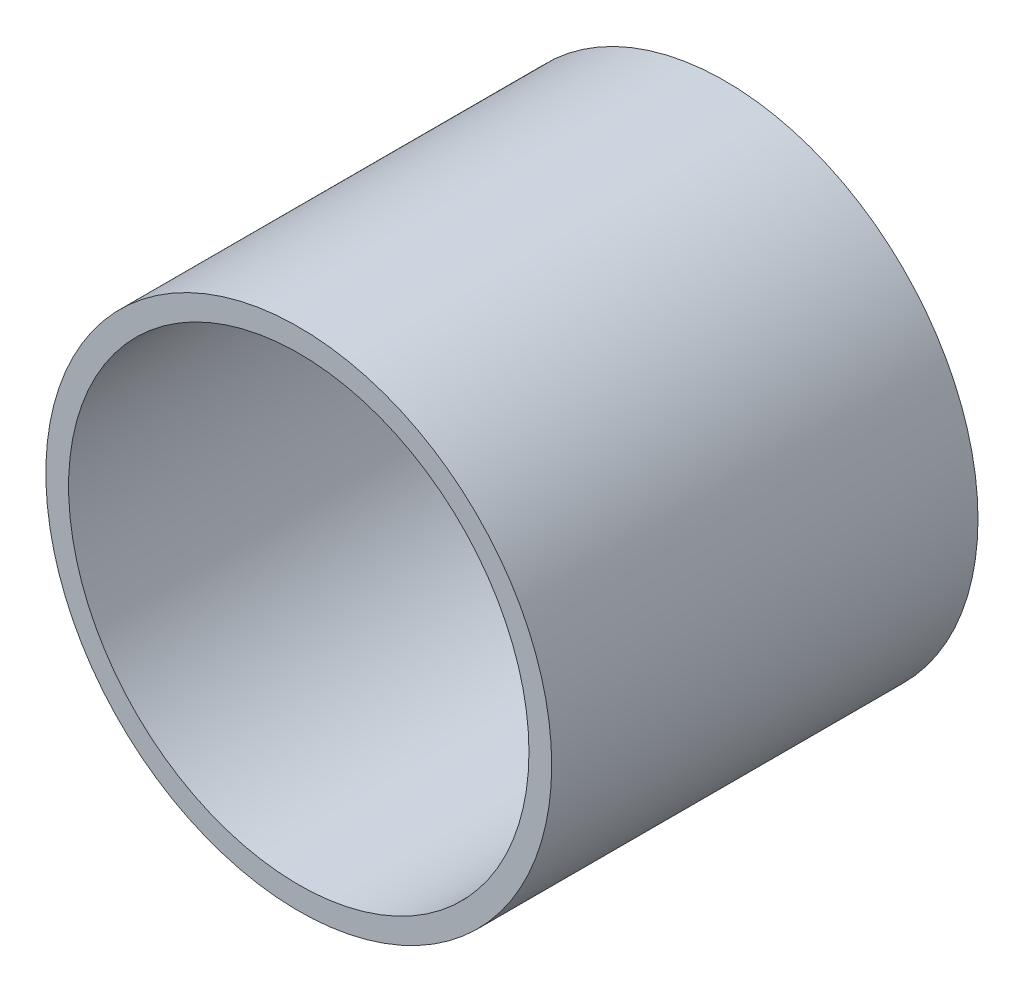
from build123d import *

# Parameters (mm, degrees)
ESQUISSE1_R      = 8.9
ESQUISSE1_R_2    = 8.1
EXTRUSION1_DEPTH = 15


with BuildPart() as part:
    # Esquisse1 → Extrusion1 (new body)
    with BuildSketch(Plane.XY):
        Circle(ESQUISSE1_R)
        Circle(ESQUISSE1_R_2, mode=Mode.SUBTRACT)
    extrude(amount=EXTRUSION1_DEPTH)


solid = part.part
